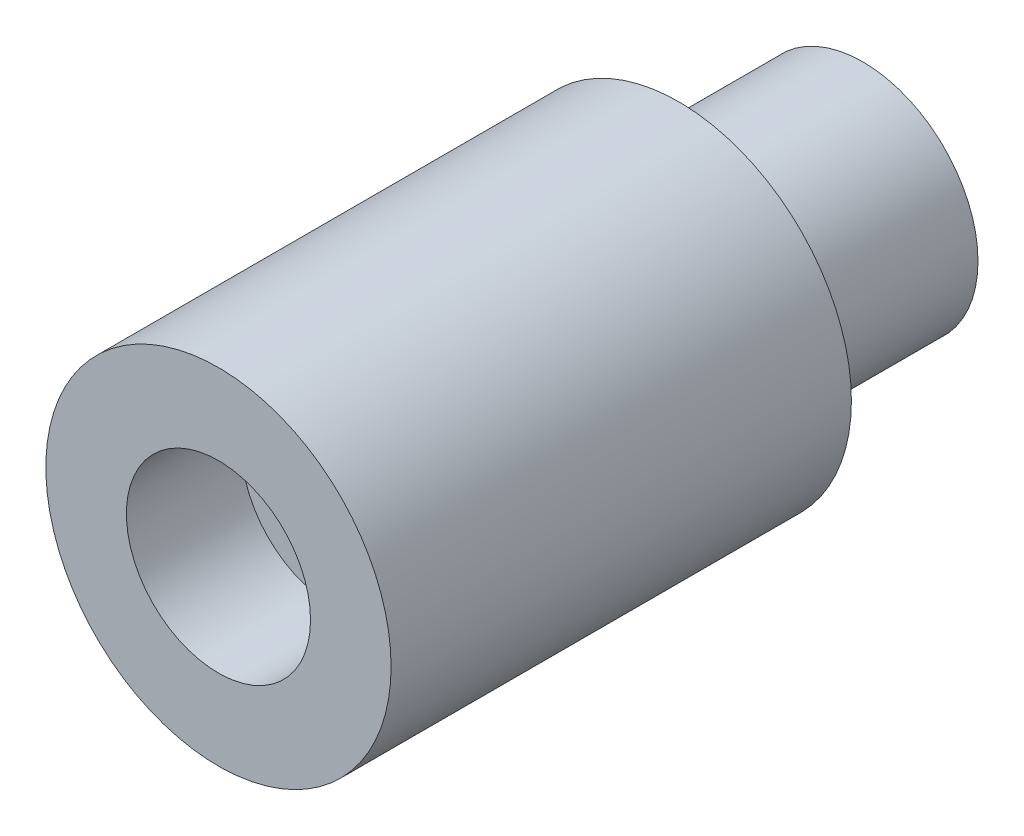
ISO-10303-21;
HEADER;
FILE_DESCRIPTION(('STEP AP214'),'2;1');
FILE_NAME('part.step','',(''),(''),'','','');
FILE_SCHEMA(('AUTOMOTIVE_DESIGN { 1 0 10303 214 1 1 1 1 }'));
ENDSEC;
DATA;
#1=APPLICATION_CONTEXT('core data for automotive mechanical design processes');
#2=APPLICATION_PROTOCOL_DEFINITION('international standard','automotive_design',2000,#1);
#3=PRODUCT_CONTEXT('',#1,'mechanical');
#4=PRODUCT('Part','Part','',(#3));
#5=PRODUCT_RELATED_PRODUCT_CATEGORY('part','',(#4));
#6=PRODUCT_DEFINITION_FORMATION('','',#4);
#7=PRODUCT_DEFINITION_CONTEXT('part definition',#1,'design');
#8=PRODUCT_DEFINITION('design','',#6,#7);
#9=PRODUCT_DEFINITION_SHAPE('','',#8);
#10=(LENGTH_UNIT() NAMED_UNIT(*) SI_UNIT(.MILLI.,.METRE.));
#11=(NAMED_UNIT(*) PLANE_ANGLE_UNIT() SI_UNIT($,.RADIAN.));
#12=(NAMED_UNIT(*) SI_UNIT($,.STERADIAN.) SOLID_ANGLE_UNIT());
#13=UNCERTAINTY_MEASURE_WITH_UNIT(LENGTH_MEASURE(1.E-05),#10,'distance_accuracy_value','');
#14=(GEOMETRIC_REPRESENTATION_CONTEXT(3) GLOBAL_UNCERTAINTY_ASSIGNED_CONTEXT((#13)) GLOBAL_UNIT_ASSIGNED_CONTEXT((#10,
#11,#12)) REPRESENTATION_CONTEXT('',''));
#15=CARTESIAN_POINT('',(0.,0.,0.));
#16=DIRECTION('',(0.,0.,1.));
#17=DIRECTION('',(1.,0.,0.));
#18=AXIS2_PLACEMENT_3D('',#15,#16,#17);
#19=CARTESIAN_POINT('',(7.5,0.,20.));
#20=DIRECTION('',(0.,0.,-1.));
#21=DIRECTION('',(-1.,0.,0.));
#22=AXIS2_PLACEMENT_3D('',#19,#20,#21);
#23=PLANE('',#22);
#24=CARTESIAN_POINT('',(0.,0.,20.));
#25=DIRECTION('',(0.,0.,1.));
#26=DIRECTION('',(1.,0.,0.));
#27=AXIS2_PLACEMENT_3D('',#24,#25,#26);
#28=CIRCLE('',#27,4.);
#29=CARTESIAN_POINT('',(4.,0.,20.));
#30=VERTEX_POINT('',#29);
#31=EDGE_CURVE('E8',#30,#30,#28,.T.);
#32=ORIENTED_EDGE('',*,*,#31,.F.);
#33=EDGE_LOOP('',(#32));
#34=FACE_BOUND('',#33,.T.);
#35=CARTESIAN_POINT('',(0.,0.,20.));
#36=DIRECTION('',(0.,0.,1.));
#37=DIRECTION('',(1.,0.,0.));
#38=AXIS2_PLACEMENT_3D('',#35,#36,#37);
#39=CIRCLE('',#38,7.5);
#40=CARTESIAN_POINT('',(7.5,0.,20.));
#41=VERTEX_POINT('',#40);
#42=EDGE_CURVE('E40',#41,#41,#39,.T.);
#43=ORIENTED_EDGE('',*,*,#42,.T.);
#44=EDGE_LOOP('',(#43));
#45=FACE_BOUND('',#44,.T.);
#46=ADVANCED_FACE('F12',(#34,#45),#23,.F.);
#47=CARTESIAN_POINT('',(0.,0.,22.));
#48=DIRECTION('',(0.,0.,1.));
#49=DIRECTION('',(1.,0.,0.));
#50=AXIS2_PLACEMENT_3D('',#47,#48,#49);
#51=CYLINDRICAL_SURFACE('',#50,4.);
#52=CARTESIAN_POINT('',(0.,0.,15.));
#53=DIRECTION('',(0.,0.,1.));
#54=DIRECTION('',(1.,0.,0.));
#55=AXIS2_PLACEMENT_3D('',#52,#53,#54);
#56=CIRCLE('',#55,4.);
#57=CARTESIAN_POINT('',(4.,0.,15.));
#58=VERTEX_POINT('',#57);
#59=EDGE_CURVE('E18',#58,#58,#56,.T.);
#60=ORIENTED_EDGE('',*,*,#59,.F.);
#61=EDGE_LOOP('',(#60));
#62=FACE_BOUND('',#61,.T.);
#63=ORIENTED_EDGE('',*,*,#31,.T.);
#64=EDGE_LOOP('',(#63));
#65=FACE_BOUND('',#64,.T.);
#66=ADVANCED_FACE('F77',(#62,#65),#51,.F.);
#67=CARTESIAN_POINT('',(4.,0.,15.));
#68=DIRECTION('',(0.,0.,-1.));
#69=DIRECTION('',(-1.,0.,0.));
#70=AXIS2_PLACEMENT_3D('',#67,#68,#69);
#71=PLANE('',#70);
#72=CARTESIAN_POINT('',(0.,0.,15.));
#73=DIRECTION('',(0.,0.,1.));
#74=DIRECTION('',(1.,0.,0.));
#75=AXIS2_PLACEMENT_3D('',#72,#73,#74);
#76=CIRCLE('',#75,2.25);
#77=CARTESIAN_POINT('',(2.25,0.,15.));
#78=VERTEX_POINT('',#77);
#79=EDGE_CURVE('E22',#78,#78,#76,.T.);
#80=ORIENTED_EDGE('',*,*,#79,.F.);
#81=EDGE_LOOP('',(#80));
#82=FACE_BOUND('',#81,.T.);
#83=ORIENTED_EDGE('',*,*,#59,.T.);
#84=EDGE_LOOP('',(#83));
#85=FACE_BOUND('',#84,.T.);
#86=ADVANCED_FACE('F72',(#82,#85),#71,.F.);
#87=CARTESIAN_POINT('',(0.,0.,22.));
#88=DIRECTION('',(0.,0.,1.));
#89=DIRECTION('',(1.,0.,0.));
#90=AXIS2_PLACEMENT_3D('',#87,#88,#89);
#91=CYLINDRICAL_SURFACE('',#90,2.25);
#92=CARTESIAN_POINT('',(0.,0.,-8.));
#93=DIRECTION('',(0.,0.,1.));
#94=DIRECTION('',(1.,0.,0.));
#95=AXIS2_PLACEMENT_3D('',#92,#93,#94);
#96=CIRCLE('',#95,2.25);
#97=CARTESIAN_POINT('',(2.25,0.,-8.));
#98=VERTEX_POINT('',#97);
#99=EDGE_CURVE('E26',#98,#98,#96,.T.);
#100=ORIENTED_EDGE('',*,*,#99,.F.);
#101=EDGE_LOOP('',(#100));
#102=FACE_BOUND('',#101,.T.);
#103=ORIENTED_EDGE('',*,*,#79,.T.);
#104=EDGE_LOOP('',(#103));
#105=FACE_BOUND('',#104,.T.);
#106=ADVANCED_FACE('F66',(#102,#105),#91,.F.);
#107=CARTESIAN_POINT('',(2.25,0.,-8.));
#108=DIRECTION('',(0.,0.,1.));
#109=DIRECTION('',(1.,0.,0.));
#110=AXIS2_PLACEMENT_3D('',#107,#108,#109);
#111=PLANE('',#110);
#112=CARTESIAN_POINT('',(0.,0.,-8.));
#113=DIRECTION('',(0.,0.,1.));
#114=DIRECTION('',(1.,0.,0.));
#115=AXIS2_PLACEMENT_3D('',#112,#113,#114);
#116=CIRCLE('',#115,5.);
#117=CARTESIAN_POINT('',(5.,0.,-8.));
#118=VERTEX_POINT('',#117);
#119=EDGE_CURVE('E31',#118,#118,#116,.T.);
#120=ORIENTED_EDGE('',*,*,#119,.F.);
#121=EDGE_LOOP('',(#120));
#122=FACE_BOUND('',#121,.T.);
#123=ORIENTED_EDGE('',*,*,#99,.T.);
#124=EDGE_LOOP('',(#123));
#125=FACE_BOUND('',#124,.T.);
#126=ADVANCED_FACE('F60',(#122,#125),#111,.F.);
#127=CARTESIAN_POINT('',(0.,0.,22.));
#128=DIRECTION('',(0.,0.,1.));
#129=DIRECTION('',(1.,0.,0.));
#130=AXIS2_PLACEMENT_3D('',#127,#128,#129);
#131=CYLINDRICAL_SURFACE('',#130,5.);
#132=CARTESIAN_POINT('',(0.,0.,0.));
#133=DIRECTION('',(0.,0.,1.));
#134=DIRECTION('',(1.,0.,0.));
#135=AXIS2_PLACEMENT_3D('',#132,#133,#134);
#136=CIRCLE('',#135,5.);
#137=CARTESIAN_POINT('',(5.,0.,0.));
#138=VERTEX_POINT('',#137);
#139=EDGE_CURVE('E34',#138,#138,#136,.T.);
#140=ORIENTED_EDGE('',*,*,#139,.F.);
#141=EDGE_LOOP('',(#140));
#142=FACE_BOUND('',#141,.T.);
#143=ORIENTED_EDGE('',*,*,#119,.T.);
#144=EDGE_LOOP('',(#143));
#145=FACE_BOUND('',#144,.T.);
#146=ADVANCED_FACE('F54',(#142,#145),#131,.T.);
#147=CARTESIAN_POINT('',(5.,0.,0.));
#148=DIRECTION('',(0.,0.,1.));
#149=DIRECTION('',(1.,0.,0.));
#150=AXIS2_PLACEMENT_3D('',#147,#148,#149);
#151=PLANE('',#150);
#152=CARTESIAN_POINT('',(0.,0.,0.));
#153=DIRECTION('',(0.,0.,1.));
#154=DIRECTION('',(1.,0.,0.));
#155=AXIS2_PLACEMENT_3D('',#152,#153,#154);
#156=CIRCLE('',#155,7.5);
#157=CARTESIAN_POINT('',(7.5,0.,0.));
#158=VERTEX_POINT('',#157);
#159=EDGE_CURVE('E37',#158,#158,#156,.T.);
#160=ORIENTED_EDGE('',*,*,#159,.F.);
#161=EDGE_LOOP('',(#160));
#162=FACE_BOUND('',#161,.T.);
#163=ORIENTED_EDGE('',*,*,#139,.T.);
#164=EDGE_LOOP('',(#163));
#165=FACE_BOUND('',#164,.T.);
#166=ADVANCED_FACE('F48',(#162,#165),#151,.F.);
#167=CARTESIAN_POINT('',(0.,0.,22.));
#168=DIRECTION('',(0.,0.,1.));
#169=DIRECTION('',(1.,0.,0.));
#170=AXIS2_PLACEMENT_3D('',#167,#168,#169);
#171=CYLINDRICAL_SURFACE('',#170,7.5);
#172=ORIENTED_EDGE('',*,*,#42,.F.);
#173=EDGE_LOOP('',(#172));
#174=FACE_BOUND('',#173,.T.);
#175=ORIENTED_EDGE('',*,*,#159,.T.);
#176=EDGE_LOOP('',(#175));
#177=FACE_BOUND('',#176,.T.);
#178=ADVANCED_FACE('F45',(#174,#177),#171,.T.);
#179=CLOSED_SHELL('',(#46,#66,#86,#106,#126,#146,#166,#178));
#180=MANIFOLD_SOLID_BREP('B1',#179);
#181=ADVANCED_BREP_SHAPE_REPRESENTATION('',(#18,#180),#14);
#182=SHAPE_DEFINITION_REPRESENTATION(#9,#181);
ENDSEC;
END-ISO-10303-21;
